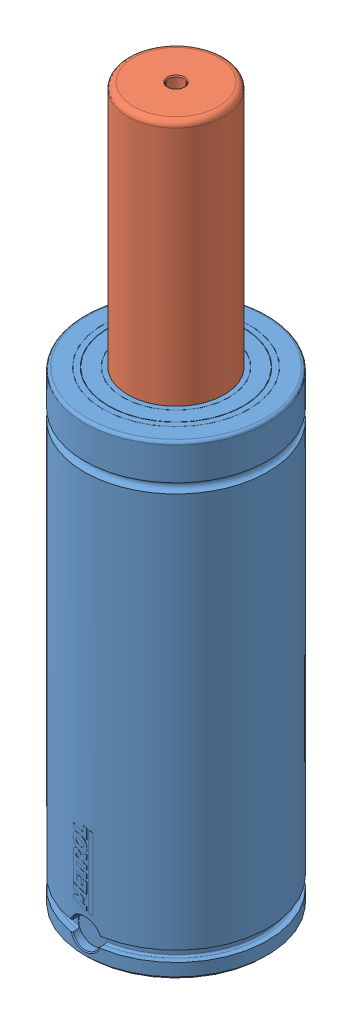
SolidWorks assembly ISNG3000-125.SLDASM, configuration Default (file format 7000). Lengths in mm.
Overall size (95 370 95.11).
2 component instances, 2 part files, 5 mates.
Components (placement in the parent):
- ISNG-3000 Body-1: ISNG-3000 Body.SLDPRT [ISNG-3000-125] x (0 0 1) z (0 -1 0) size (95.11 95 242)
- ISNG-3000 Piston-1: ISNG-3000 Piston.SLDPRT [ISNG-3000-125] at (0 217 0) x (0.586604 0 -0.809874) z (0 -1 0) size (60 60 153)
Mates (geometry in assembly coordinates):
- Coincident1: coincident aligned: circle of ISNG-3000 Body-1; cylinder of ISNG-3000 Piston-1 through (0 217 0) axis (0 -1 0) radius 25
- LimitDistance1: limit distance anti-aligned: plane of ISNG-3000 Piston-1 through (24.2962 222 17.5981) normal (0 1 0); plane of ISNG-3000 Body-1 through (-25 222 0) normal (0 -1 0)
- Coincident2: coincident anti-aligned: plane of ISNG-3000 Body-1 through (0 0 0) normal (0 -1 0); plane of assembly through (0 0 0) normal (0 1 0)
- Coincident3: coincident aligned: plane of ISNG-3000 Body-1; plane of assembly through (0 0 0) normal (0 0 1)
- Coincident4: coincident anti-aligned: plane of ISNG-3000 Body-1; plane of assembly through (0 0 0) normal (1 0 0)
